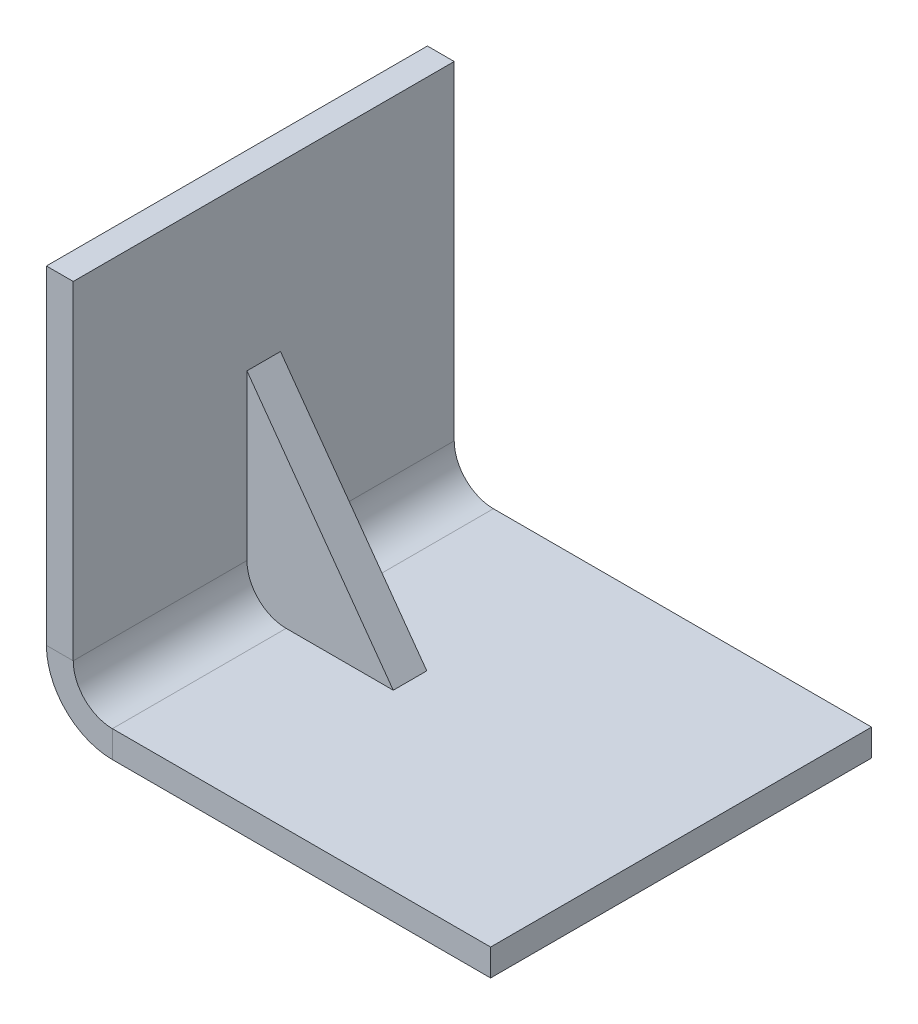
ISO-10303-21;
HEADER;
FILE_DESCRIPTION(('STEP AP214'),'2;1');
FILE_NAME('part.step','',(''),(''),'','','');
FILE_SCHEMA(('AUTOMOTIVE_DESIGN { 1 0 10303 214 1 1 1 1 }'));
ENDSEC;
DATA;
#1=APPLICATION_CONTEXT('core data for automotive mechanical design processes');
#2=APPLICATION_PROTOCOL_DEFINITION('international standard','automotive_design',2000,#1);
#3=PRODUCT_CONTEXT('',#1,'mechanical');
#4=PRODUCT('Part','Part','',(#3));
#5=PRODUCT_RELATED_PRODUCT_CATEGORY('part','',(#4));
#6=PRODUCT_DEFINITION_FORMATION('','',#4);
#7=PRODUCT_DEFINITION_CONTEXT('part definition',#1,'design');
#8=PRODUCT_DEFINITION('design','',#6,#7);
#9=PRODUCT_DEFINITION_SHAPE('','',#8);
#10=(LENGTH_UNIT() NAMED_UNIT(*) SI_UNIT(.MILLI.,.METRE.));
#11=(NAMED_UNIT(*) PLANE_ANGLE_UNIT() SI_UNIT($,.RADIAN.));
#12=(NAMED_UNIT(*) SI_UNIT($,.STERADIAN.) SOLID_ANGLE_UNIT());
#13=UNCERTAINTY_MEASURE_WITH_UNIT(LENGTH_MEASURE(1.E-05),#10,'distance_accuracy_value','');
#14=(GEOMETRIC_REPRESENTATION_CONTEXT(3) GLOBAL_UNCERTAINTY_ASSIGNED_CONTEXT((#13)) GLOBAL_UNIT_ASSIGNED_CONTEXT((#10,
#11,#12)) REPRESENTATION_CONTEXT('',''));
#15=CARTESIAN_POINT('',(0.,0.,0.));
#16=DIRECTION('',(0.,0.,1.));
#17=DIRECTION('',(1.,0.,0.));
#18=AXIS2_PLACEMENT_3D('',#15,#16,#17);
#19=CARTESIAN_POINT('',(5.93600006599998,5.936000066,0.));
#20=DIRECTION('',(0.,0.,1.));
#21=DIRECTION('',(-1.,0.,0.));
#22=AXIS2_PLACEMENT_3D('',#19,#20,#21);
#23=CYLINDRICAL_SURFACE('',#22,5.936000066);
#24=CARTESIAN_POINT('',(5.93600006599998,5.936000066,-31.4045158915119));
#25=DIRECTION('',(0.,0.,1.));
#26=DIRECTION('',(1.,0.,0.));
#27=AXIS2_PLACEMENT_3D('',#24,#25,#26);
#28=CIRCLE('',#27,5.936000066);
#29=CARTESIAN_POINT('',(5.93600006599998,0.,-31.4045158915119));
#30=VERTEX_POINT('',#29);
#31=CARTESIAN_POINT('',(0.,5.93600006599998,-31.4045158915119));
#32=VERTEX_POINT('',#31);
#33=EDGE_CURVE('E49',#30,#32,#28,.F.);
#34=ORIENTED_EDGE('',*,*,#33,.F.);
#35=DIRECTION('',(0.,0.,1.));
#36=VECTOR('',#35,1.);
#37=CARTESIAN_POINT('',(5.93600006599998,0.,0.));
#38=LINE('',#37,#36);
#39=CARTESIAN_POINT('',(5.93600006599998,0.,-57.7290317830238));
#40=VERTEX_POINT('',#39);
#41=EDGE_CURVE('E144',#30,#40,#38,.F.);
#42=ORIENTED_EDGE('',*,*,#41,.T.);
#43=CARTESIAN_POINT('',(5.93600006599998,5.936000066,-57.7290317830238));
#44=DIRECTION('',(0.,0.,1.));
#45=DIRECTION('',(1.,0.,0.));
#46=AXIS2_PLACEMENT_3D('',#43,#44,#45);
#47=CIRCLE('',#46,5.936000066);
#48=CARTESIAN_POINT('',(0.,5.93600006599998,-57.7290317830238));
#49=VERTEX_POINT('',#48);
#50=EDGE_CURVE('E192',#40,#49,#47,.F.);
#51=ORIENTED_EDGE('',*,*,#50,.T.);
#52=DIRECTION('',(0.,0.,1.));
#53=VECTOR('',#52,1.);
#54=CARTESIAN_POINT('',(0.,5.93600006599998,-57.7290317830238));
#55=LINE('',#54,#53);
#56=EDGE_CURVE('E152',#49,#32,#55,.T.);
#57=ORIENTED_EDGE('',*,*,#56,.T.);
#58=EDGE_LOOP('',(#34,#42,#51,#57));
#59=FACE_BOUND('',#58,.T.);
#60=ADVANCED_FACE('F34',(#59),#23,.F.);
#61=CARTESIAN_POINT('',(0.,-4.064,0.));
#62=DIRECTION('',(0.,0.,1.));
#63=DIRECTION('',(1.,0.,0.));
#64=AXIS2_PLACEMENT_3D('',#61,#62,#63);
#65=PLANE('',#64);
#66=DIRECTION('',(1.,0.,0.));
#67=VECTOR('',#66,1.);
#68=CARTESIAN_POINT('',(0.,0.,0.));
#69=LINE('',#68,#67);
#70=CARTESIAN_POINT('',(5.93600006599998,0.,0.));
#71=VERTEX_POINT('',#70);
#72=CARTESIAN_POINT('',(63.2434022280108,0.,0.));
#73=VERTEX_POINT('',#72);
#74=EDGE_CURVE('E203',#71,#73,#69,.T.);
#75=ORIENTED_EDGE('',*,*,#74,.F.);
#76=DIRECTION('',(0.,-1.,0.));
#77=VECTOR('',#76,1.);
#78=CARTESIAN_POINT('',(5.93600006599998,0.,0.));
#79=LINE('',#78,#77);
#80=CARTESIAN_POINT('',(5.93600006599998,-4.064,0.));
#81=VERTEX_POINT('',#80);
#82=EDGE_CURVE('E189',#71,#81,#79,.T.);
#83=ORIENTED_EDGE('',*,*,#82,.T.);
#84=DIRECTION('',(1.,0.,0.));
#85=VECTOR('',#84,1.);
#86=CARTESIAN_POINT('',(0.,-4.064,0.));
#87=LINE('',#86,#85);
#88=CARTESIAN_POINT('',(63.2434022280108,-4.064,0.));
#89=VERTEX_POINT('',#88);
#90=EDGE_CURVE('E206',#81,#89,#87,.T.);
#91=ORIENTED_EDGE('',*,*,#90,.T.);
#92=DIRECTION('',(0.,1.,0.));
#93=VECTOR('',#92,1.);
#94=CARTESIAN_POINT('',(63.2434022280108,-4.064,0.));
#95=LINE('',#94,#93);
#96=EDGE_CURVE('E215',#89,#73,#95,.T.);
#97=ORIENTED_EDGE('',*,*,#96,.T.);
#98=EDGE_LOOP('',(#75,#83,#91,#97));
#99=FACE_BOUND('',#98,.T.);
#100=ADVANCED_FACE('F36',(#99),#65,.T.);
#101=CARTESIAN_POINT('',(0.,-4.064,0.));
#102=DIRECTION('',(0.,-1.,0.));
#103=DIRECTION('',(0.,0.,-1.));
#104=AXIS2_PLACEMENT_3D('',#101,#102,#103);
#105=PLANE('',#104);
#106=DIRECTION('',(0.,0.,1.));
#107=VECTOR('',#106,1.);
#108=CARTESIAN_POINT('',(5.93600006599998,-4.064,0.));
#109=LINE('',#108,#107);
#110=CARTESIAN_POINT('',(5.93600006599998,-4.064,-57.7290317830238));
#111=VERTEX_POINT('',#110);
#112=EDGE_CURVE('E57',#81,#111,#109,.F.);
#113=ORIENTED_EDGE('',*,*,#112,.T.);
#114=DIRECTION('',(-1.,0.,0.));
#115=VECTOR('',#114,1.);
#116=CARTESIAN_POINT('',(0.,-4.064,-57.7290317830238));
#117=LINE('',#116,#115);
#118=CARTESIAN_POINT('',(63.2434022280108,-4.064,-57.7290317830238));
#119=VERTEX_POINT('',#118);
#120=EDGE_CURVE('E212',#119,#111,#117,.T.);
#121=ORIENTED_EDGE('',*,*,#120,.F.);
#122=DIRECTION('',(0.,0.,-1.));
#123=VECTOR('',#122,1.);
#124=CARTESIAN_POINT('',(63.2434022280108,-4.064,0.));
#125=LINE('',#124,#123);
#126=EDGE_CURVE('E208',#89,#119,#125,.T.);
#127=ORIENTED_EDGE('',*,*,#126,.F.);
#128=ORIENTED_EDGE('',*,*,#90,.F.);
#129=EDGE_LOOP('',(#113,#121,#127,#128));
#130=FACE_BOUND('',#129,.T.);
#131=ADVANCED_FACE('F267',(#130),#105,.T.);
#132=CARTESIAN_POINT('',(0.,0.,0.));
#133=DIRECTION('',(0.,-1.,0.));
#134=DIRECTION('',(0.,0.,-1.));
#135=AXIS2_PLACEMENT_3D('',#132,#133,#134);
#136=PLANE('',#135);
#137=DIRECTION('',(0.,0.,1.));
#138=VECTOR('',#137,1.);
#139=CARTESIAN_POINT('',(22.1676172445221,0.,0.));
#140=LINE('',#139,#138);
#141=CARTESIAN_POINT('',(22.1676172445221,0.,-31.4045158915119));
#142=VERTEX_POINT('',#141);
#143=CARTESIAN_POINT('',(22.1676172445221,0.,-26.3245158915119));
#144=VERTEX_POINT('',#143);
#145=EDGE_CURVE('E124',#142,#144,#140,.T.);
#146=ORIENTED_EDGE('',*,*,#145,.T.);
#147=DIRECTION('',(-1.,0.,0.));
#148=VECTOR('',#147,1.);
#149=CARTESIAN_POINT('',(0.,0.,-26.3245158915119));
#150=LINE('',#149,#148);
#151=CARTESIAN_POINT('',(5.93600006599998,0.,-26.3245158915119));
#152=VERTEX_POINT('',#151);
#153=EDGE_CURVE('E135',#144,#152,#150,.T.);
#154=ORIENTED_EDGE('',*,*,#153,.T.);
#155=EDGE_CURVE('E195',#71,#152,#38,.F.);
#156=ORIENTED_EDGE('',*,*,#155,.F.);
#157=ORIENTED_EDGE('',*,*,#74,.T.);
#158=DIRECTION('',(0.,0.,-1.));
#159=VECTOR('',#158,1.);
#160=CARTESIAN_POINT('',(63.2434022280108,0.,0.));
#161=LINE('',#160,#159);
#162=CARTESIAN_POINT('',(63.2434022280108,0.,-57.7290317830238));
#163=VERTEX_POINT('',#162);
#164=EDGE_CURVE('E217',#73,#163,#161,.T.);
#165=ORIENTED_EDGE('',*,*,#164,.T.);
#166=DIRECTION('',(-1.,0.,0.));
#167=VECTOR('',#166,1.);
#168=CARTESIAN_POINT('',(0.,0.,-57.7290317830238));
#169=LINE('',#168,#167);
#170=EDGE_CURVE('E209',#163,#40,#169,.T.);
#171=ORIENTED_EDGE('',*,*,#170,.T.);
#172=ORIENTED_EDGE('',*,*,#41,.F.);
#173=DIRECTION('',(-1.,0.,0.));
#174=VECTOR('',#173,1.);
#175=CARTESIAN_POINT('',(0.,0.,-31.4045158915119));
#176=LINE('',#175,#174);
#177=EDGE_CURVE('E138',#142,#30,#176,.T.);
#178=ORIENTED_EDGE('',*,*,#177,.F.);
#179=EDGE_LOOP('',(#146,#154,#156,#157,#165,#171,#172,#178));
#180=FACE_BOUND('',#179,.T.);
#181=ADVANCED_FACE('F142',(#180),#136,.F.);
#182=CARTESIAN_POINT('',(0.,-4.064,-57.7290317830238));
#183=DIRECTION('',(0.,0.,-1.));
#184=DIRECTION('',(-1.,0.,0.));
#185=AXIS2_PLACEMENT_3D('',#182,#183,#184);
#186=PLANE('',#185);
#187=DIRECTION('',(0.,-1.,0.));
#188=VECTOR('',#187,1.);
#189=CARTESIAN_POINT('',(5.93600006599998,0.,-57.7290317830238));
#190=LINE('',#189,#188);
#191=EDGE_CURVE('E200',#40,#111,#190,.T.);
#192=ORIENTED_EDGE('',*,*,#191,.F.);
#193=ORIENTED_EDGE('',*,*,#170,.F.);
#194=DIRECTION('',(0.,1.,0.));
#195=VECTOR('',#194,1.);
#196=CARTESIAN_POINT('',(63.2434022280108,-4.064,-57.7290317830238));
#197=LINE('',#196,#195);
#198=EDGE_CURVE('E221',#119,#163,#197,.T.);
#199=ORIENTED_EDGE('',*,*,#198,.F.);
#200=ORIENTED_EDGE('',*,*,#120,.T.);
#201=EDGE_LOOP('',(#192,#193,#199,#200));
#202=FACE_BOUND('',#201,.T.);
#203=ADVANCED_FACE('F265',(#202),#186,.T.);
#204=CARTESIAN_POINT('',(63.2434022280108,-4.064,0.));
#205=DIRECTION('',(1.,0.,0.));
#206=DIRECTION('',(0.,0.,-1.));
#207=AXIS2_PLACEMENT_3D('',#204,#205,#206);
#208=PLANE('',#207);
#209=ORIENTED_EDGE('',*,*,#164,.F.);
#210=ORIENTED_EDGE('',*,*,#96,.F.);
#211=ORIENTED_EDGE('',*,*,#126,.T.);
#212=ORIENTED_EDGE('',*,*,#198,.T.);
#213=EDGE_LOOP('',(#209,#210,#211,#212));
#214=FACE_BOUND('',#213,.T.);
#215=ADVANCED_FACE('F270',(#214),#208,.T.);
#216=CARTESIAN_POINT('',(5.93600006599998,5.936000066,-57.7290317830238));
#217=DIRECTION('',(0.,0.,-1.));
#218=DIRECTION('',(-1.,0.,0.));
#219=AXIS2_PLACEMENT_3D('',#216,#217,#218);
#220=PLANE('',#219);
#221=DIRECTION('',(-1.,0.,0.));
#222=VECTOR('',#221,1.);
#223=CARTESIAN_POINT('',(0.,5.93600006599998,-57.7290317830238));
#224=LINE('',#223,#222);
#225=CARTESIAN_POINT('',(-4.06400000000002,5.93600006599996,-57.7290317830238));
#226=VERTEX_POINT('',#225);
#227=EDGE_CURVE('E134',#49,#226,#224,.T.);
#228=ORIENTED_EDGE('',*,*,#227,.F.);
#229=ORIENTED_EDGE('',*,*,#50,.F.);
#230=ORIENTED_EDGE('',*,*,#191,.T.);
#231=CARTESIAN_POINT('',(5.93600006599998,5.936000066,-57.7290317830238));
#232=DIRECTION('',(0.,0.,1.));
#233=DIRECTION('',(1.,0.,0.));
#234=AXIS2_PLACEMENT_3D('',#231,#232,#233);
#235=CIRCLE('',#234,10.000000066);
#236=EDGE_CURVE('E185',#111,#226,#235,.F.);
#237=ORIENTED_EDGE('',*,*,#236,.T.);
#238=EDGE_LOOP('',(#228,#229,#230,#237));
#239=FACE_BOUND('',#238,.T.);
#240=ADVANCED_FACE('F254',(#239),#220,.T.);
#241=CARTESIAN_POINT('',(5.93600006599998,5.936000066,0.));
#242=DIRECTION('',(0.,0.,-1.));
#243=DIRECTION('',(-1.,0.,0.));
#244=AXIS2_PLACEMENT_3D('',#241,#242,#243);
#245=PLANE('',#244);
#246=CARTESIAN_POINT('',(5.93600006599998,5.936000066,0.));
#247=DIRECTION('',(0.,0.,1.));
#248=DIRECTION('',(1.,0.,0.));
#249=AXIS2_PLACEMENT_3D('',#246,#247,#248);
#250=CIRCLE('',#249,5.936000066);
#251=CARTESIAN_POINT('',(0.,5.93600006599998,0.));
#252=VERTEX_POINT('',#251);
#253=EDGE_CURVE('E183',#252,#71,#250,.T.);
#254=ORIENTED_EDGE('',*,*,#253,.F.);
#255=DIRECTION('',(-1.,0.,0.));
#256=VECTOR('',#255,1.);
#257=CARTESIAN_POINT('',(0.,5.93600006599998,0.));
#258=LINE('',#257,#256);
#259=CARTESIAN_POINT('',(-4.06400000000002,5.93600006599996,0.));
#260=VERTEX_POINT('',#259);
#261=EDGE_CURVE('E155',#252,#260,#258,.T.);
#262=ORIENTED_EDGE('',*,*,#261,.T.);
#263=CARTESIAN_POINT('',(5.93600006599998,5.936000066,0.));
#264=DIRECTION('',(0.,0.,1.));
#265=DIRECTION('',(1.,0.,0.));
#266=AXIS2_PLACEMENT_3D('',#263,#264,#265);
#267=CIRCLE('',#266,10.000000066);
#268=EDGE_CURVE('E186',#260,#81,#267,.T.);
#269=ORIENTED_EDGE('',*,*,#268,.T.);
#270=ORIENTED_EDGE('',*,*,#82,.F.);
#271=EDGE_LOOP('',(#254,#262,#269,#270));
#272=FACE_BOUND('',#271,.T.);
#273=ADVANCED_FACE('F240',(#272),#245,.F.);
#274=CARTESIAN_POINT('',(5.93600006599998,5.936000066,0.));
#275=DIRECTION('',(0.,0.,1.));
#276=DIRECTION('',(-1.,0.,0.));
#277=AXIS2_PLACEMENT_3D('',#274,#275,#276);
#278=CYLINDRICAL_SURFACE('',#277,10.000000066);
#279=DIRECTION('',(0.,0.,-1.));
#280=VECTOR('',#279,1.);
#281=CARTESIAN_POINT('',(-4.06400000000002,5.93600006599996,0.));
#282=LINE('',#281,#280);
#283=EDGE_CURVE('E159',#260,#226,#282,.T.);
#284=ORIENTED_EDGE('',*,*,#283,.T.);
#285=ORIENTED_EDGE('',*,*,#236,.F.);
#286=ORIENTED_EDGE('',*,*,#112,.F.);
#287=ORIENTED_EDGE('',*,*,#268,.F.);
#288=EDGE_LOOP('',(#284,#285,#286,#287));
#289=FACE_BOUND('',#288,.T.);
#290=ADVANCED_FACE('F252',(#289),#278,.T.);
#291=ORIENTED_EDGE('',*,*,#155,.T.);
#292=CARTESIAN_POINT('',(5.93600006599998,5.936000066,-26.3245158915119));
#293=DIRECTION('',(0.,0.,1.));
#294=DIRECTION('',(1.,0.,0.));
#295=AXIS2_PLACEMENT_3D('',#292,#293,#294);
#296=CIRCLE('',#295,5.936000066);
#297=CARTESIAN_POINT('',(0.,5.93600006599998,-26.3245158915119));
#298=VERTEX_POINT('',#297);
#299=EDGE_CURVE('E145',#152,#298,#296,.F.);
#300=ORIENTED_EDGE('',*,*,#299,.T.);
#301=EDGE_CURVE('E156',#298,#252,#55,.T.);
#302=ORIENTED_EDGE('',*,*,#301,.T.);
#303=ORIENTED_EDGE('',*,*,#253,.T.);
#304=EDGE_LOOP('',(#291,#300,#302,#303));
#305=FACE_BOUND('',#304,.T.);
#306=ADVANCED_FACE('F236',(#305),#23,.F.);
#307=CARTESIAN_POINT('',(-4.064,0.,-57.7290317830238));
#308=DIRECTION('',(0.,0.,1.));
#309=DIRECTION('',(1.,0.,0.));
#310=AXIS2_PLACEMENT_3D('',#307,#308,#309);
#311=PLANE('',#310);
#312=ORIENTED_EDGE('',*,*,#227,.T.);
#313=DIRECTION('',(0.,-1.,0.));
#314=VECTOR('',#313,1.);
#315=CARTESIAN_POINT('',(-4.064,0.,-57.7290317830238));
#316=LINE('',#315,#314);
#317=CARTESIAN_POINT('',(-4.06400000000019,55.720000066,-57.7290317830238));
#318=VERTEX_POINT('',#317);
#319=EDGE_CURVE('E164',#318,#226,#316,.T.);
#320=ORIENTED_EDGE('',*,*,#319,.F.);
#321=DIRECTION('',(1.,0.,0.));
#322=VECTOR('',#321,1.);
#323=CARTESIAN_POINT('',(-4.06400000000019,55.720000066,-57.7290317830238));
#324=LINE('',#323,#322);
#325=CARTESIAN_POINT('',(-1.94545340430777E-13,55.720000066,-57.7290317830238));
#326=VERTEX_POINT('',#325);
#327=EDGE_CURVE('E172',#318,#326,#324,.T.);
#328=ORIENTED_EDGE('',*,*,#327,.T.);
#329=DIRECTION('',(0.,-1.,0.));
#330=VECTOR('',#329,1.);
#331=CARTESIAN_POINT('',(0.,0.,-57.7290317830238));
#332=LINE('',#331,#330);
#333=EDGE_CURVE('E163',#326,#49,#332,.T.);
#334=ORIENTED_EDGE('',*,*,#333,.T.);
#335=EDGE_LOOP('',(#312,#320,#328,#334));
#336=FACE_BOUND('',#335,.T.);
#337=ADVANCED_FACE('F258',(#336),#311,.F.);
#338=CARTESIAN_POINT('',(-4.06400000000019,55.720000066,0.));
#339=DIRECTION('',(0.,0.,-1.));
#340=DIRECTION('',(-1.,0.,0.));
#341=AXIS2_PLACEMENT_3D('',#338,#339,#340);
#342=PLANE('',#341);
#343=ORIENTED_EDGE('',*,*,#261,.F.);
#344=DIRECTION('',(0.,1.,0.));
#345=VECTOR('',#344,1.);
#346=CARTESIAN_POINT('',(-1.94545340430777E-13,55.720000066,0.));
#347=LINE('',#346,#345);
#348=CARTESIAN_POINT('',(-1.94545340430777E-13,55.720000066,0.));
#349=VERTEX_POINT('',#348);
#350=EDGE_CURVE('E175',#252,#349,#347,.T.);
#351=ORIENTED_EDGE('',*,*,#350,.T.);
#352=DIRECTION('',(1.,0.,0.));
#353=VECTOR('',#352,1.);
#354=CARTESIAN_POINT('',(-4.06400000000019,55.720000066,0.));
#355=LINE('',#354,#353);
#356=CARTESIAN_POINT('',(-4.06400000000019,55.720000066,0.));
#357=VERTEX_POINT('',#356);
#358=EDGE_CURVE('E180',#357,#349,#355,.T.);
#359=ORIENTED_EDGE('',*,*,#358,.F.);
#360=DIRECTION('',(0.,1.,0.));
#361=VECTOR('',#360,1.);
#362=CARTESIAN_POINT('',(-4.06400000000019,55.720000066,0.));
#363=LINE('',#362,#361);
#364=EDGE_CURVE('E167',#260,#357,#363,.T.);
#365=ORIENTED_EDGE('',*,*,#364,.F.);
#366=EDGE_LOOP('',(#343,#351,#359,#365));
#367=FACE_BOUND('',#366,.T.);
#368=ADVANCED_FACE('F244',(#367),#342,.F.);
#369=CARTESIAN_POINT('',(-4.064,0.,0.));
#370=DIRECTION('',(1.,0.,0.));
#371=DIRECTION('',(0.,1.,0.));
#372=AXIS2_PLACEMENT_3D('',#369,#370,#371);
#373=PLANE('',#372);
#374=ORIENTED_EDGE('',*,*,#319,.T.);
#375=ORIENTED_EDGE('',*,*,#283,.F.);
#376=ORIENTED_EDGE('',*,*,#364,.T.);
#377=DIRECTION('',(0.,0.,-1.));
#378=VECTOR('',#377,1.);
#379=CARTESIAN_POINT('',(-4.06400000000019,55.720000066,-57.7290317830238));
#380=LINE('',#379,#378);
#381=EDGE_CURVE('E170',#357,#318,#380,.T.);
#382=ORIENTED_EDGE('',*,*,#381,.T.);
#383=EDGE_LOOP('',(#374,#375,#376,#382));
#384=FACE_BOUND('',#383,.T.);
#385=ADVANCED_FACE('F248',(#384),#373,.F.);
#386=CARTESIAN_POINT('',(0.,0.,0.));
#387=DIRECTION('',(1.,0.,0.));
#388=DIRECTION('',(0.,1.,0.));
#389=AXIS2_PLACEMENT_3D('',#386,#387,#388);
#390=PLANE('',#389);
#391=DIRECTION('',(0.,-1.,0.));
#392=VECTOR('',#391,1.);
#393=CARTESIAN_POINT('',(0.,0.,-26.3245158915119));
#394=LINE('',#393,#392);
#395=CARTESIAN_POINT('',(-1.09328844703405E-13,30.828000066,-26.3245158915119));
#396=VERTEX_POINT('',#395);
#397=EDGE_CURVE('E11',#396,#298,#394,.T.);
#398=ORIENTED_EDGE('',*,*,#397,.F.);
#399=DIRECTION('',(0.,0.,1.));
#400=VECTOR('',#399,1.);
#401=CARTESIAN_POINT('',(-1.07635386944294E-13,30.828000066,0.));
#402=LINE('',#401,#400);
#403=CARTESIAN_POINT('',(-1.09328844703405E-13,30.828000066,-31.4045158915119));
#404=VERTEX_POINT('',#403);
#405=EDGE_CURVE('E42',#404,#396,#402,.T.);
#406=ORIENTED_EDGE('',*,*,#405,.F.);
#407=DIRECTION('',(0.,-1.,0.));
#408=VECTOR('',#407,1.);
#409=CARTESIAN_POINT('',(0.,0.,-31.4045158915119));
#410=LINE('',#409,#408);
#411=EDGE_CURVE('E139',#404,#32,#410,.T.);
#412=ORIENTED_EDGE('',*,*,#411,.T.);
#413=ORIENTED_EDGE('',*,*,#56,.F.);
#414=ORIENTED_EDGE('',*,*,#333,.F.);
#415=DIRECTION('',(0.,0.,-1.));
#416=VECTOR('',#415,1.);
#417=CARTESIAN_POINT('',(-1.94545340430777E-13,55.720000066,-57.7290317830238));
#418=LINE('',#417,#416);
#419=EDGE_CURVE('E168',#349,#326,#418,.T.);
#420=ORIENTED_EDGE('',*,*,#419,.F.);
#421=ORIENTED_EDGE('',*,*,#350,.F.);
#422=ORIENTED_EDGE('',*,*,#301,.F.);
#423=EDGE_LOOP('',(#398,#406,#412,#413,#414,#420,#421,#422));
#424=FACE_BOUND('',#423,.T.);
#425=ADVANCED_FACE('F231',(#424),#390,.T.);
#426=CARTESIAN_POINT('',(-4.06400000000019,55.720000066,-57.7290317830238));
#427=DIRECTION('',(0.,-1.,0.));
#428=DIRECTION('',(1.,0.,0.));
#429=AXIS2_PLACEMENT_3D('',#426,#427,#428);
#430=PLANE('',#429);
#431=ORIENTED_EDGE('',*,*,#419,.T.);
#432=ORIENTED_EDGE('',*,*,#327,.F.);
#433=ORIENTED_EDGE('',*,*,#381,.F.);
#434=ORIENTED_EDGE('',*,*,#358,.T.);
#435=EDGE_LOOP('',(#431,#432,#433,#434));
#436=FACE_BOUND('',#435,.T.);
#437=ADVANCED_FACE('F297',(#436),#430,.F.);
#438=CARTESIAN_POINT('',(22.1676172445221,0.,-28.8645158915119));
#439=DIRECTION('',(0.811890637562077,0.583809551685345,0.));
#440=DIRECTION('',(-0.583809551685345,0.811890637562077,0.));
#441=AXIS2_PLACEMENT_3D('',#438,#439,#440);
#442=PLANE('',#441);
#443=ORIENTED_EDGE('',*,*,#145,.F.);
#444=DIRECTION('',(-0.583809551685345,0.811890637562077,0.));
#445=VECTOR('',#444,1.);
#446=CARTESIAN_POINT('',(22.1676172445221,0.,-31.4045158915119));
#447=LINE('',#446,#445);
#448=EDGE_CURVE('E127',#142,#404,#447,.T.);
#449=ORIENTED_EDGE('',*,*,#448,.T.);
#450=ORIENTED_EDGE('',*,*,#405,.T.);
#451=DIRECTION('',(-0.583809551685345,0.811890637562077,0.));
#452=VECTOR('',#451,1.);
#453=CARTESIAN_POINT('',(22.1676172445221,0.,-26.3245158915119));
#454=LINE('',#453,#452);
#455=EDGE_CURVE('E130',#144,#396,#454,.T.);
#456=ORIENTED_EDGE('',*,*,#455,.F.);
#457=EDGE_LOOP('',(#443,#449,#450,#456));
#458=FACE_BOUND('',#457,.T.);
#459=ADVANCED_FACE('F126',(#458),#442,.T.);
#460=CARTESIAN_POINT('',(29.5897011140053,25.828000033,-26.3245158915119));
#461=DIRECTION('',(0.,0.,1.));
#462=DIRECTION('',(1.,0.,0.));
#463=AXIS2_PLACEMENT_3D('',#460,#461,#462);
#464=PLANE('',#463);
#465=ORIENTED_EDGE('',*,*,#153,.F.);
#466=ORIENTED_EDGE('',*,*,#455,.T.);
#467=ORIENTED_EDGE('',*,*,#397,.T.);
#468=ORIENTED_EDGE('',*,*,#299,.F.);
#469=EDGE_LOOP('',(#465,#466,#467,#468));
#470=FACE_BOUND('',#469,.T.);
#471=ADVANCED_FACE('F228',(#470),#464,.T.);
#472=CARTESIAN_POINT('',(29.5897011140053,25.828000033,-31.4045158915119));
#473=DIRECTION('',(0.,0.,1.));
#474=DIRECTION('',(1.,0.,0.));
#475=AXIS2_PLACEMENT_3D('',#472,#473,#474);
#476=PLANE('',#475);
#477=ORIENTED_EDGE('',*,*,#448,.F.);
#478=ORIENTED_EDGE('',*,*,#177,.T.);
#479=ORIENTED_EDGE('',*,*,#33,.T.);
#480=ORIENTED_EDGE('',*,*,#411,.F.);
#481=EDGE_LOOP('',(#477,#478,#479,#480));
#482=FACE_BOUND('',#481,.T.);
#483=ADVANCED_FACE('F137',(#482),#476,.F.);
#484=CLOSED_SHELL('',(#60,#100,#131,#181,#203,#215,#240,#273,#290,#306,#337,#368,#385,#425,#437,
#459,#471,#483));
#485=MANIFOLD_SOLID_BREP('B2',#484);
#486=ADVANCED_BREP_SHAPE_REPRESENTATION('',(#18,#485),#14);
#487=SHAPE_DEFINITION_REPRESENTATION(#9,#486);
ENDSEC;
END-ISO-10303-21;
